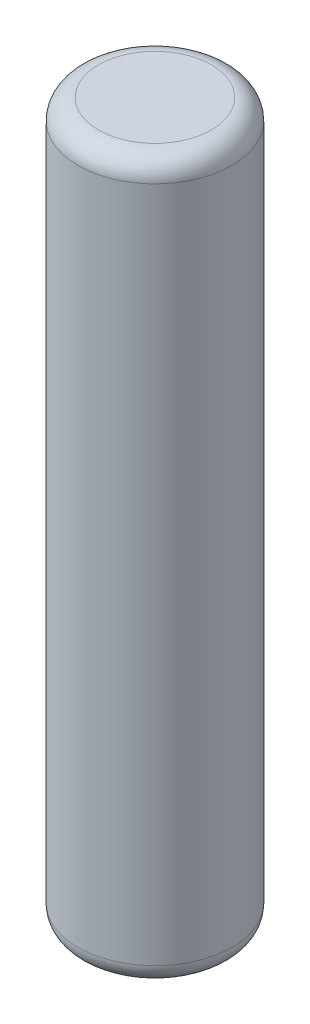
ISO-10303-21;
HEADER;
FILE_DESCRIPTION(('STEP AP214'),'2;1');
FILE_NAME('part.step','',(''),(''),'','','');
FILE_SCHEMA(('AUTOMOTIVE_DESIGN { 1 0 10303 214 1 1 1 1 }'));
ENDSEC;
DATA;
#1=APPLICATION_CONTEXT('core data for automotive mechanical design processes');
#2=APPLICATION_PROTOCOL_DEFINITION('international standard','automotive_design',2000,#1);
#3=PRODUCT_CONTEXT('',#1,'mechanical');
#4=PRODUCT('Part','Part','',(#3));
#5=PRODUCT_RELATED_PRODUCT_CATEGORY('part','',(#4));
#6=PRODUCT_DEFINITION_FORMATION('','',#4);
#7=PRODUCT_DEFINITION_CONTEXT('part definition',#1,'design');
#8=PRODUCT_DEFINITION('design','',#6,#7);
#9=PRODUCT_DEFINITION_SHAPE('','',#8);
#10=(LENGTH_UNIT() NAMED_UNIT(*) SI_UNIT(.MILLI.,.METRE.));
#11=(NAMED_UNIT(*) PLANE_ANGLE_UNIT() SI_UNIT($,.RADIAN.));
#12=(NAMED_UNIT(*) SI_UNIT($,.STERADIAN.) SOLID_ANGLE_UNIT());
#13=UNCERTAINTY_MEASURE_WITH_UNIT(LENGTH_MEASURE(1.E-05),#10,'distance_accuracy_value','');
#14=(GEOMETRIC_REPRESENTATION_CONTEXT(3) GLOBAL_UNCERTAINTY_ASSIGNED_CONTEXT((#13)) GLOBAL_UNIT_ASSIGNED_CONTEXT((#10,
#11,#12)) REPRESENTATION_CONTEXT('',''));
#15=CARTESIAN_POINT('',(0.,0.,0.));
#16=DIRECTION('',(0.,0.,1.));
#17=DIRECTION('',(1.,0.,0.));
#18=AXIS2_PLACEMENT_3D('',#15,#16,#17);
#19=CARTESIAN_POINT('',(0.,3.5,0.));
#20=DIRECTION('',(0.,-1.,0.));
#21=DIRECTION('',(0.,0.,-1.));
#22=AXIS2_PLACEMENT_3D('',#19,#20,#21);
#23=CYLINDRICAL_SURFACE('',#22,0.375);
#24=CARTESIAN_POINT('',(0.,0.0999999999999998,0.));
#25=DIRECTION('',(0.,1.,0.));
#26=DIRECTION('',(0.,0.,1.));
#27=AXIS2_PLACEMENT_3D('',#24,#25,#26);
#28=CIRCLE('',#27,0.375);
#29=CARTESIAN_POINT('',(0.,0.0999999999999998,0.375));
#30=VERTEX_POINT('',#29);
#31=EDGE_CURVE('E43',#30,#30,#28,.T.);
#32=ORIENTED_EDGE('',*,*,#31,.T.);
#33=EDGE_LOOP('',(#32));
#34=FACE_BOUND('',#33,.T.);
#35=CARTESIAN_POINT('',(0.,3.4,0.));
#36=DIRECTION('',(0.,1.,0.));
#37=DIRECTION('',(0.,0.,1.));
#38=AXIS2_PLACEMENT_3D('',#35,#36,#37);
#39=CIRCLE('',#38,0.375);
#40=CARTESIAN_POINT('',(0.,3.4,0.375));
#41=VERTEX_POINT('',#40);
#42=EDGE_CURVE('E47',#41,#41,#39,.F.);
#43=ORIENTED_EDGE('',*,*,#42,.T.);
#44=EDGE_LOOP('',(#43));
#45=FACE_BOUND('',#44,.T.);
#46=ADVANCED_FACE('F32',(#34,#45),#23,.T.);
#47=CARTESIAN_POINT('',(0.,3.5,0.));
#48=DIRECTION('',(0.,1.,0.));
#49=DIRECTION('',(0.,0.,1.));
#50=AXIS2_PLACEMENT_3D('',#47,#48,#49);
#51=PLANE('',#50);
#52=CARTESIAN_POINT('',(0.,3.5,0.));
#53=DIRECTION('',(0.,1.,0.));
#54=DIRECTION('',(0.,0.,1.));
#55=AXIS2_PLACEMENT_3D('',#52,#53,#54);
#56=CIRCLE('',#55,0.275);
#57=CARTESIAN_POINT('',(0.,3.5,0.275));
#58=VERTEX_POINT('',#57);
#59=EDGE_CURVE('E10',#58,#58,#56,.T.);
#60=ORIENTED_EDGE('',*,*,#59,.T.);
#61=EDGE_LOOP('',(#60));
#62=FACE_BOUND('',#61,.T.);
#63=ADVANCED_FACE('F63',(#62),#51,.T.);
#64=CARTESIAN_POINT('',(0.,0.,0.));
#65=DIRECTION('',(0.,1.,0.));
#66=DIRECTION('',(0.,0.,1.));
#67=AXIS2_PLACEMENT_3D('',#64,#65,#66);
#68=PLANE('',#67);
#69=CARTESIAN_POINT('',(0.,0.,0.));
#70=DIRECTION('',(0.,1.,0.));
#71=DIRECTION('',(0.,0.,1.));
#72=AXIS2_PLACEMENT_3D('',#69,#70,#71);
#73=CIRCLE('',#72,0.275);
#74=CARTESIAN_POINT('',(0.,0.,0.275));
#75=VERTEX_POINT('',#74);
#76=EDGE_CURVE('E39',#75,#75,#73,.F.);
#77=ORIENTED_EDGE('',*,*,#76,.T.);
#78=EDGE_LOOP('',(#77));
#79=FACE_BOUND('',#78,.T.);
#80=ADVANCED_FACE('F60',(#79),#68,.F.);
#81=CARTESIAN_POINT('',(0.,0.0999999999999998,0.));
#82=DIRECTION('',(0.,1.,0.));
#83=DIRECTION('',(0.,0.,1.));
#84=AXIS2_PLACEMENT_3D('',#81,#82,#83);
#85=TOROIDAL_SURFACE('',#84,0.275,0.1);
#86=ORIENTED_EDGE('',*,*,#76,.F.);
#87=EDGE_LOOP('',(#86));
#88=FACE_BOUND('',#87,.T.);
#89=ORIENTED_EDGE('',*,*,#31,.F.);
#90=EDGE_LOOP('',(#89));
#91=FACE_BOUND('',#90,.T.);
#92=ADVANCED_FACE('F56',(#88,#91),#85,.T.);
#93=CARTESIAN_POINT('',(0.,3.4,0.));
#94=DIRECTION('',(0.,1.,0.));
#95=DIRECTION('',(0.,0.,1.));
#96=AXIS2_PLACEMENT_3D('',#93,#94,#95);
#97=TOROIDAL_SURFACE('',#96,0.275,0.1);
#98=ORIENTED_EDGE('',*,*,#42,.F.);
#99=EDGE_LOOP('',(#98));
#100=FACE_BOUND('',#99,.T.);
#101=ORIENTED_EDGE('',*,*,#59,.F.);
#102=EDGE_LOOP('',(#101));
#103=FACE_BOUND('',#102,.T.);
#104=ADVANCED_FACE('F34',(#100,#103),#97,.T.);
#105=CLOSED_SHELL('',(#46,#63,#80,#92,#104));
#106=MANIFOLD_SOLID_BREP('B2',#105);
#107=ADVANCED_BREP_SHAPE_REPRESENTATION('',(#18,#106),#14);
#108=SHAPE_DEFINITION_REPRESENTATION(#9,#107);
ENDSEC;
END-ISO-10303-21;
